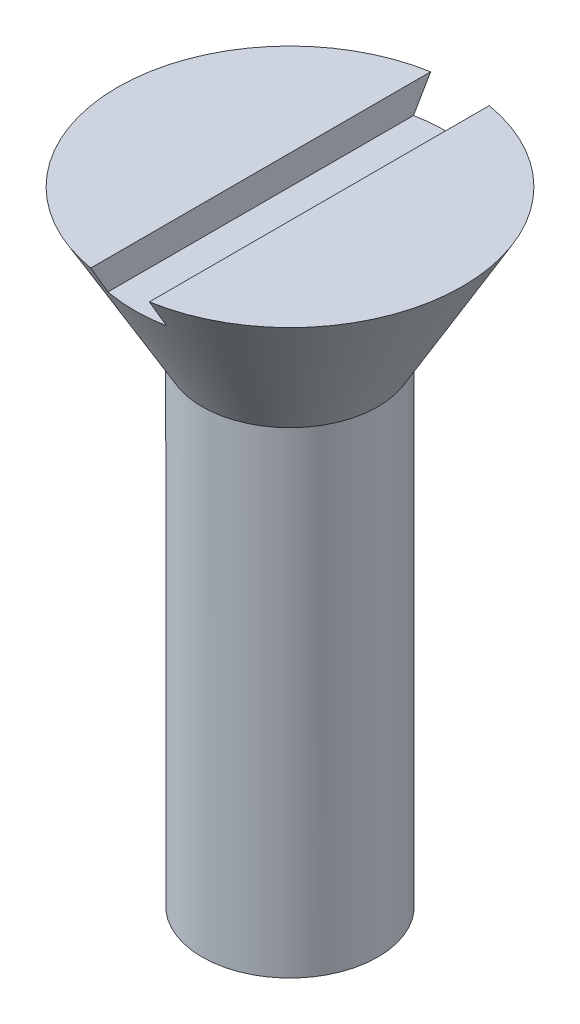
from build123d import *

# Parameters (mm, degrees)
SKETCH2_W      = 2
SKETCH2_H      = 13.991333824
EXTRUDE1_DEPTH = 1


with BuildPart() as part:
    # Sketch1 → Revolve1 (revolve)
    with BuildSketch(Plane.XY, mode=Mode.PRIVATE) as revolve1_sk:
        Polygon((0, 0), (0, 23), (-5.886751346, 23), (-3, 18), (-3, 1.732050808), align=None)
    revolve(revolve1_sk.sketch.rotate(Axis((0, 0, 0), (0, 1, 0)), 270), axis=Axis((0, 0, 0), (0, 1, 0)))

    # Sketch2 → Extrude1 (cut)
    with BuildSketch(Plane(origin=(0, 23, 0), x_dir=(1, 0, 0), z_dir=(0, 1, 0))):
        Rectangle(SKETCH2_W, SKETCH2_H)
    extrude(amount=-EXTRUDE1_DEPTH, mode=Mode.SUBTRACT)


solid = part.part
